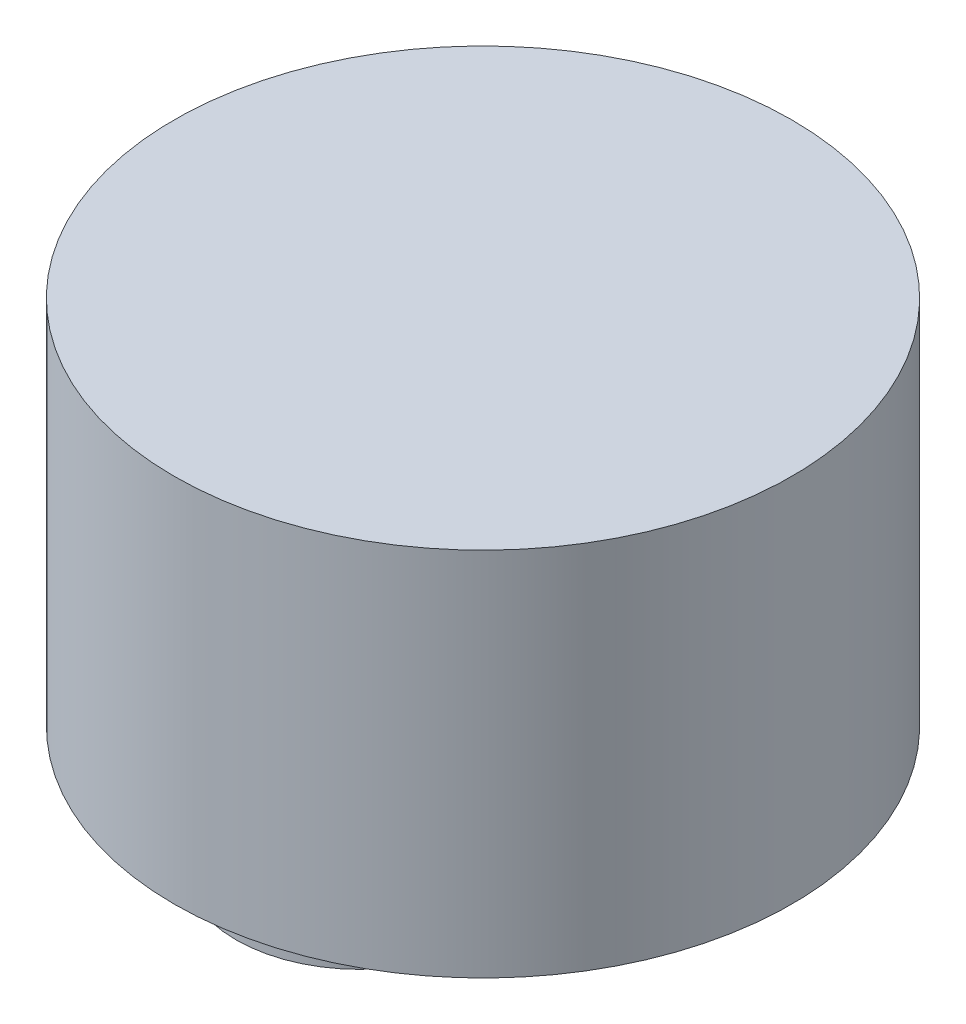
from build123d import *

# Parameters (mm, degrees)
SKETCH1_R           = 2.5
BOSS_EXTRUDE1_DEPTH = 3
SKETCH2_R           = 1
BOSS_EXTRUDE2_DEPTH = 1.5


with BuildPart() as part:
    # Sketch1 → Boss-Extrude1 (new body)
    with BuildSketch(Plane(origin=(0, 0, 0), x_dir=(1, 0, 0), z_dir=(0, 1, 0))):
        with Locations(Location((0, 0, 0), (0, 0, 270))):
            Circle(SKETCH1_R)
    extrude(amount=BOSS_EXTRUDE1_DEPTH)

    # Sketch2 → Boss-Extrude2 (add)
    with BuildSketch(Plane.XZ):
        with Locations(Location((-1, 0, 0), (0, 0, 90))):
            Circle(SKETCH2_R)
    extrude(amount=BOSS_EXTRUDE2_DEPTH)


solid = part.part
